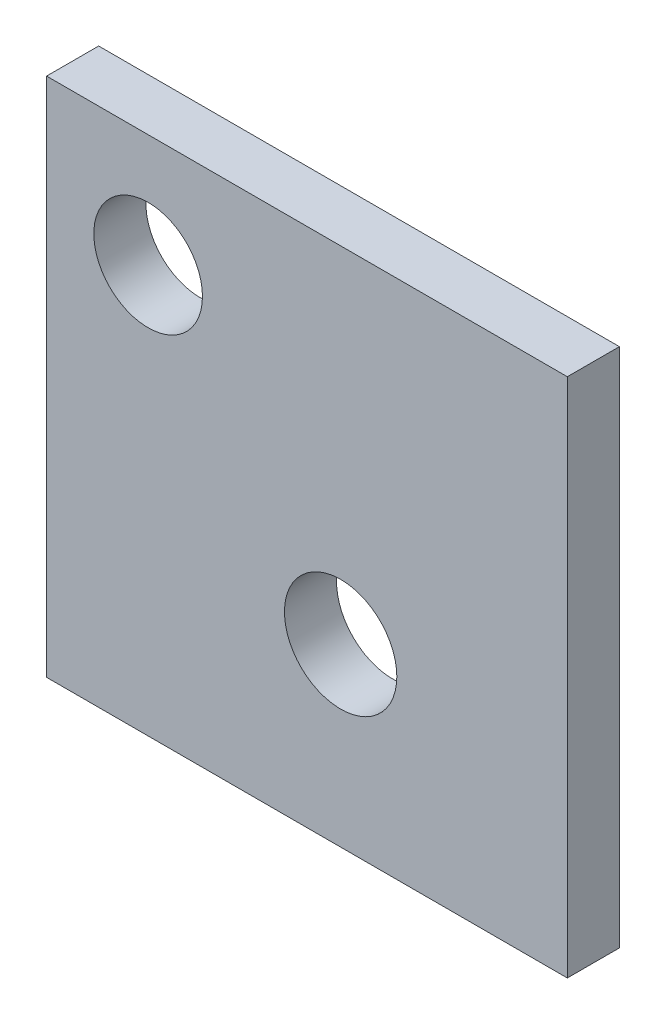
ISO-10303-21;
HEADER;
FILE_DESCRIPTION(('STEP AP214'),'2;1');
FILE_NAME('part.step','',(''),(''),'','','');
FILE_SCHEMA(('AUTOMOTIVE_DESIGN { 1 0 10303 214 1 1 1 1 }'));
ENDSEC;
DATA;
#1=APPLICATION_CONTEXT('core data for automotive mechanical design processes');
#2=APPLICATION_PROTOCOL_DEFINITION('international standard','automotive_design',2000,#1);
#3=PRODUCT_CONTEXT('',#1,'mechanical');
#4=PRODUCT('Part','Part','',(#3));
#5=PRODUCT_RELATED_PRODUCT_CATEGORY('part','',(#4));
#6=PRODUCT_DEFINITION_FORMATION('','',#4);
#7=PRODUCT_DEFINITION_CONTEXT('part definition',#1,'design');
#8=PRODUCT_DEFINITION('design','',#6,#7);
#9=PRODUCT_DEFINITION_SHAPE('','',#8);
#10=(LENGTH_UNIT() NAMED_UNIT(*) SI_UNIT(.MILLI.,.METRE.));
#11=(NAMED_UNIT(*) PLANE_ANGLE_UNIT() SI_UNIT($,.RADIAN.));
#12=(NAMED_UNIT(*) SI_UNIT($,.STERADIAN.) SOLID_ANGLE_UNIT());
#13=UNCERTAINTY_MEASURE_WITH_UNIT(LENGTH_MEASURE(1.E-05),#10,'distance_accuracy_value','');
#14=(GEOMETRIC_REPRESENTATION_CONTEXT(3) GLOBAL_UNCERTAINTY_ASSIGNED_CONTEXT((#13)) GLOBAL_UNIT_ASSIGNED_CONTEXT((#10,
#11,#12)) REPRESENTATION_CONTEXT('',''));
#15=CARTESIAN_POINT('',(0.,0.,0.));
#16=DIRECTION('',(0.,0.,1.));
#17=DIRECTION('',(1.,0.,0.));
#18=AXIS2_PLACEMENT_3D('',#15,#16,#17);
#19=CARTESIAN_POINT('',(50.,50.,10.));
#20=DIRECTION('',(-1.,0.,0.));
#21=DIRECTION('',(0.,-1.,0.));
#22=AXIS2_PLACEMENT_3D('',#19,#20,#21);
#23=PLANE('',#22);
#24=DIRECTION('',(0.,1.,0.));
#25=VECTOR('',#24,1.);
#26=CARTESIAN_POINT('',(50.,50.,0.));
#27=LINE('',#26,#25);
#28=CARTESIAN_POINT('',(50.,-50.,0.));
#29=VERTEX_POINT('',#28);
#30=CARTESIAN_POINT('',(50.,50.,0.));
#31=VERTEX_POINT('',#30);
#32=EDGE_CURVE('E96',#29,#31,#27,.T.);
#33=ORIENTED_EDGE('',*,*,#32,.T.);
#34=DIRECTION('',(0.,0.,-1.));
#35=VECTOR('',#34,1.);
#36=CARTESIAN_POINT('',(50.,50.,10.));
#37=LINE('',#36,#35);
#38=CARTESIAN_POINT('',(50.,50.,10.));
#39=VERTEX_POINT('',#38);
#40=EDGE_CURVE('E11',#39,#31,#37,.T.);
#41=ORIENTED_EDGE('',*,*,#40,.F.);
#42=DIRECTION('',(0.,1.,0.));
#43=VECTOR('',#42,1.);
#44=CARTESIAN_POINT('',(50.,50.,10.));
#45=LINE('',#44,#43);
#46=CARTESIAN_POINT('',(50.,-50.,10.));
#47=VERTEX_POINT('',#46);
#48=EDGE_CURVE('E84',#47,#39,#45,.T.);
#49=ORIENTED_EDGE('',*,*,#48,.F.);
#50=DIRECTION('',(0.,0.,-1.));
#51=VECTOR('',#50,1.);
#52=CARTESIAN_POINT('',(50.,-50.,10.));
#53=LINE('',#52,#51);
#54=EDGE_CURVE('E92',#47,#29,#53,.T.);
#55=ORIENTED_EDGE('',*,*,#54,.T.);
#56=EDGE_LOOP('',(#33,#41,#49,#55));
#57=FACE_BOUND('',#56,.T.);
#58=ADVANCED_FACE('F33',(#57),#23,.F.);
#59=CARTESIAN_POINT('',(-50.,50.,10.));
#60=DIRECTION('',(0.,-1.,0.));
#61=DIRECTION('',(0.,0.,-1.));
#62=AXIS2_PLACEMENT_3D('',#59,#60,#61);
#63=PLANE('',#62);
#64=DIRECTION('',(-1.,0.,0.));
#65=VECTOR('',#64,1.);
#66=CARTESIAN_POINT('',(-50.,50.,0.));
#67=LINE('',#66,#65);
#68=CARTESIAN_POINT('',(-50.,50.,0.));
#69=VERTEX_POINT('',#68);
#70=EDGE_CURVE('E88',#31,#69,#67,.T.);
#71=ORIENTED_EDGE('',*,*,#70,.T.);
#72=DIRECTION('',(0.,0.,-1.));
#73=VECTOR('',#72,1.);
#74=CARTESIAN_POINT('',(-50.,50.,10.));
#75=LINE('',#74,#73);
#76=CARTESIAN_POINT('',(-50.,50.,10.));
#77=VERTEX_POINT('',#76);
#78=EDGE_CURVE('E41',#77,#69,#75,.T.);
#79=ORIENTED_EDGE('',*,*,#78,.F.);
#80=DIRECTION('',(-1.,0.,0.));
#81=VECTOR('',#80,1.);
#82=CARTESIAN_POINT('',(-50.,50.,10.));
#83=LINE('',#82,#81);
#84=EDGE_CURVE('E79',#39,#77,#83,.T.);
#85=ORIENTED_EDGE('',*,*,#84,.F.);
#86=ORIENTED_EDGE('',*,*,#40,.T.);
#87=EDGE_LOOP('',(#71,#79,#85,#86));
#88=FACE_BOUND('',#87,.T.);
#89=ADVANCED_FACE('F87',(#88),#63,.F.);
#90=CARTESIAN_POINT('',(-50.,50.,10.));
#91=DIRECTION('',(1.,0.,0.));
#92=DIRECTION('',(0.,1.,0.));
#93=AXIS2_PLACEMENT_3D('',#90,#91,#92);
#94=PLANE('',#93);
#95=DIRECTION('',(0.,-1.,0.));
#96=VECTOR('',#95,1.);
#97=CARTESIAN_POINT('',(-50.,50.,0.));
#98=LINE('',#97,#96);
#99=CARTESIAN_POINT('',(-50.,-50.,0.));
#100=VERTEX_POINT('',#99);
#101=EDGE_CURVE('E66',#69,#100,#98,.T.);
#102=ORIENTED_EDGE('',*,*,#101,.T.);
#103=DIRECTION('',(0.,0.,-1.));
#104=VECTOR('',#103,1.);
#105=CARTESIAN_POINT('',(-50.,-50.,10.));
#106=LINE('',#105,#104);
#107=CARTESIAN_POINT('',(-50.,-50.,10.));
#108=VERTEX_POINT('',#107);
#109=EDGE_CURVE('E89',#108,#100,#106,.T.);
#110=ORIENTED_EDGE('',*,*,#109,.F.);
#111=DIRECTION('',(0.,-1.,0.));
#112=VECTOR('',#111,1.);
#113=CARTESIAN_POINT('',(-50.,50.,10.));
#114=LINE('',#113,#112);
#115=EDGE_CURVE('E82',#77,#108,#114,.T.);
#116=ORIENTED_EDGE('',*,*,#115,.F.);
#117=ORIENTED_EDGE('',*,*,#78,.T.);
#118=EDGE_LOOP('',(#102,#110,#116,#117));
#119=FACE_BOUND('',#118,.T.);
#120=ADVANCED_FACE('F90',(#119),#94,.F.);
#121=CARTESIAN_POINT('',(-50.,-50.,10.));
#122=DIRECTION('',(0.,1.,0.));
#123=DIRECTION('',(0.,0.,1.));
#124=AXIS2_PLACEMENT_3D('',#121,#122,#123);
#125=PLANE('',#124);
#126=DIRECTION('',(1.,0.,0.));
#127=VECTOR('',#126,1.);
#128=CARTESIAN_POINT('',(-50.,-50.,0.));
#129=LINE('',#128,#127);
#130=EDGE_CURVE('E72',#100,#29,#129,.T.);
#131=ORIENTED_EDGE('',*,*,#130,.T.);
#132=ORIENTED_EDGE('',*,*,#54,.F.);
#133=DIRECTION('',(1.,0.,0.));
#134=VECTOR('',#133,1.);
#135=CARTESIAN_POINT('',(-50.,-50.,10.));
#136=LINE('',#135,#134);
#137=EDGE_CURVE('E49',#108,#47,#136,.T.);
#138=ORIENTED_EDGE('',*,*,#137,.F.);
#139=ORIENTED_EDGE('',*,*,#109,.T.);
#140=EDGE_LOOP('',(#131,#132,#138,#139));
#141=FACE_BOUND('',#140,.T.);
#142=ADVANCED_FACE('F104',(#141),#125,.F.);
#143=CARTESIAN_POINT('',(0.,0.,10.));
#144=DIRECTION('',(0.,0.,1.));
#145=DIRECTION('',(1.,0.,0.));
#146=AXIS2_PLACEMENT_3D('',#143,#144,#145);
#147=PLANE('',#146);
#148=CARTESIAN_POINT('',(6.46882980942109,-16.257320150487,10.));
#149=DIRECTION('',(0.,0.,1.));
#150=DIRECTION('',(1.,0.,0.));
#151=AXIS2_PLACEMENT_3D('',#148,#149,#150);
#152=CIRCLE('',#151,10.7885887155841);
#153=CARTESIAN_POINT('',(17.2574185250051,-16.257320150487,10.));
#154=VERTEX_POINT('',#153);
#155=EDGE_CURVE('E116',#154,#154,#152,.T.);
#156=ORIENTED_EDGE('',*,*,#155,.F.);
#157=EDGE_LOOP('',(#156));
#158=FACE_BOUND('',#157,.T.);
#159=CARTESIAN_POINT('',(-30.5003052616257,28.3196517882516,10.));
#160=DIRECTION('',(0.,0.,1.));
#161=DIRECTION('',(1.,0.,0.));
#162=AXIS2_PLACEMENT_3D('',#159,#160,#161);
#163=CIRCLE('',#162,10.4299465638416);
#164=CARTESIAN_POINT('',(-20.0703586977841,28.3196517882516,10.));
#165=VERTEX_POINT('',#164);
#166=EDGE_CURVE('E110',#165,#165,#163,.T.);
#167=ORIENTED_EDGE('',*,*,#166,.F.);
#168=EDGE_LOOP('',(#167));
#169=FACE_BOUND('',#168,.T.);
#170=ORIENTED_EDGE('',*,*,#48,.T.);
#171=ORIENTED_EDGE('',*,*,#84,.T.);
#172=ORIENTED_EDGE('',*,*,#115,.T.);
#173=ORIENTED_EDGE('',*,*,#137,.T.);
#174=EDGE_LOOP('',(#170,#171,#172,#173));
#175=FACE_BOUND('',#174,.T.);
#176=ADVANCED_FACE('F80',(#158,#169,#175),#147,.T.);
#177=CARTESIAN_POINT('',(0.,0.,0.));
#178=DIRECTION('',(0.,0.,1.));
#179=DIRECTION('',(1.,0.,0.));
#180=AXIS2_PLACEMENT_3D('',#177,#178,#179);
#181=PLANE('',#180);
#182=CARTESIAN_POINT('',(6.46882980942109,-16.257320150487,0.));
#183=DIRECTION('',(0.,0.,1.));
#184=DIRECTION('',(1.,0.,0.));
#185=AXIS2_PLACEMENT_3D('',#182,#183,#184);
#186=CIRCLE('',#185,10.7885887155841);
#187=CARTESIAN_POINT('',(17.2574185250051,-16.257320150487,0.));
#188=VERTEX_POINT('',#187);
#189=EDGE_CURVE('E113',#188,#188,#186,.T.);
#190=ORIENTED_EDGE('',*,*,#189,.T.);
#191=EDGE_LOOP('',(#190));
#192=FACE_BOUND('',#191,.T.);
#193=CARTESIAN_POINT('',(-30.5003052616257,28.3196517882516,0.));
#194=DIRECTION('',(0.,0.,1.));
#195=DIRECTION('',(1.,0.,0.));
#196=AXIS2_PLACEMENT_3D('',#193,#194,#195);
#197=CIRCLE('',#196,10.4299465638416);
#198=CARTESIAN_POINT('',(-20.0703586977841,28.3196517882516,0.));
#199=VERTEX_POINT('',#198);
#200=EDGE_CURVE('E99',#199,#199,#197,.T.);
#201=ORIENTED_EDGE('',*,*,#200,.T.);
#202=EDGE_LOOP('',(#201));
#203=FACE_BOUND('',#202,.T.);
#204=ORIENTED_EDGE('',*,*,#32,.F.);
#205=ORIENTED_EDGE('',*,*,#130,.F.);
#206=ORIENTED_EDGE('',*,*,#101,.F.);
#207=ORIENTED_EDGE('',*,*,#70,.F.);
#208=EDGE_LOOP('',(#204,#205,#206,#207));
#209=FACE_BOUND('',#208,.T.);
#210=ADVANCED_FACE('F107',(#192,#203,#209),#181,.F.);
#211=CARTESIAN_POINT('',(-30.5003052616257,28.3196517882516,0.));
#212=DIRECTION('',(0.,0.,1.));
#213=DIRECTION('',(1.,0.,0.));
#214=AXIS2_PLACEMENT_3D('',#211,#212,#213);
#215=CYLINDRICAL_SURFACE('',#214,10.4299465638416);
#216=ORIENTED_EDGE('',*,*,#200,.F.);
#217=EDGE_LOOP('',(#216));
#218=FACE_BOUND('',#217,.T.);
#219=ORIENTED_EDGE('',*,*,#166,.T.);
#220=EDGE_LOOP('',(#219));
#221=FACE_BOUND('',#220,.T.);
#222=ADVANCED_FACE('F127',(#218,#221),#215,.F.);
#223=CARTESIAN_POINT('',(6.46882980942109,-16.257320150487,0.));
#224=DIRECTION('',(0.,0.,1.));
#225=DIRECTION('',(1.,0.,0.));
#226=AXIS2_PLACEMENT_3D('',#223,#224,#225);
#227=CYLINDRICAL_SURFACE('',#226,10.7885887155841);
#228=ORIENTED_EDGE('',*,*,#189,.F.);
#229=EDGE_LOOP('',(#228));
#230=FACE_BOUND('',#229,.T.);
#231=ORIENTED_EDGE('',*,*,#155,.T.);
#232=EDGE_LOOP('',(#231));
#233=FACE_BOUND('',#232,.T.);
#234=ADVANCED_FACE('F124',(#230,#233),#227,.F.);
#235=CLOSED_SHELL('',(#58,#89,#120,#142,#176,#210,#222,#234));
#236=MANIFOLD_SOLID_BREP('B2',#235);
#237=ADVANCED_BREP_SHAPE_REPRESENTATION('',(#18,#236),#14);
#238=SHAPE_DEFINITION_REPRESENTATION(#9,#237);
ENDSEC;
END-ISO-10303-21;
